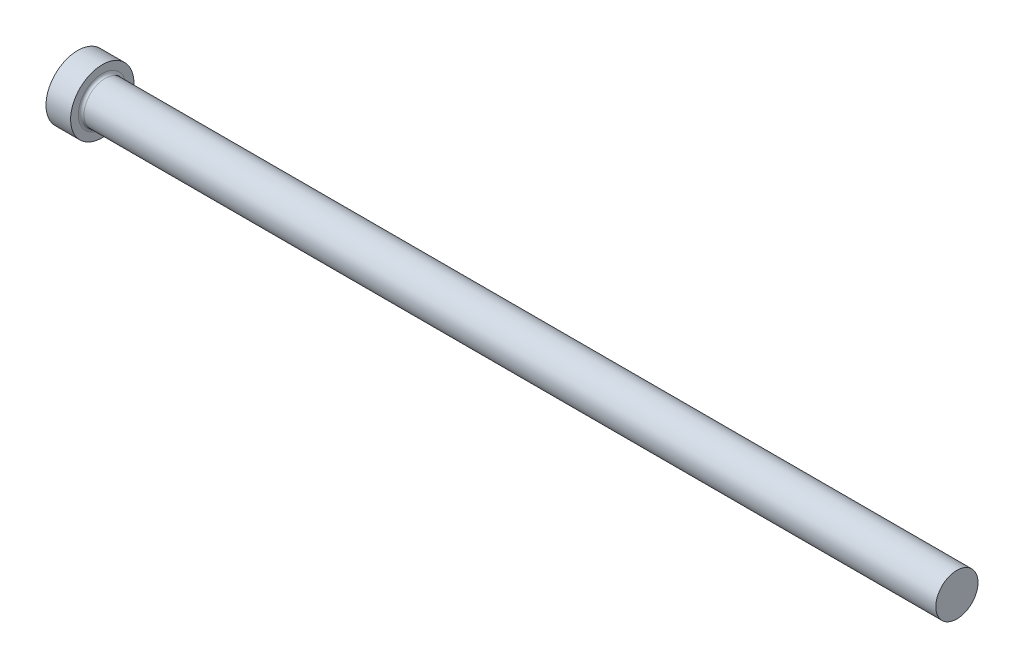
ISO-10303-21;
HEADER;
FILE_DESCRIPTION(('STEP AP214'),'2;1');
FILE_NAME('part.step','',(''),(''),'','','');
FILE_SCHEMA(('AUTOMOTIVE_DESIGN { 1 0 10303 214 1 1 1 1 }'));
ENDSEC;
DATA;
#1=APPLICATION_CONTEXT('core data for automotive mechanical design processes');
#2=APPLICATION_PROTOCOL_DEFINITION('international standard','automotive_design',2000,#1);
#3=PRODUCT_CONTEXT('',#1,'mechanical');
#4=PRODUCT('Part','Part','',(#3));
#5=PRODUCT_RELATED_PRODUCT_CATEGORY('part','',(#4));
#6=PRODUCT_DEFINITION_FORMATION('','',#4);
#7=PRODUCT_DEFINITION_CONTEXT('part definition',#1,'design');
#8=PRODUCT_DEFINITION('design','',#6,#7);
#9=PRODUCT_DEFINITION_SHAPE('','',#8);
#10=(LENGTH_UNIT() NAMED_UNIT(*) SI_UNIT(.MILLI.,.METRE.));
#11=(NAMED_UNIT(*) PLANE_ANGLE_UNIT() SI_UNIT($,.RADIAN.));
#12=(NAMED_UNIT(*) SI_UNIT($,.STERADIAN.) SOLID_ANGLE_UNIT());
#13=UNCERTAINTY_MEASURE_WITH_UNIT(LENGTH_MEASURE(1.E-05),#10,'distance_accuracy_value','');
#14=(GEOMETRIC_REPRESENTATION_CONTEXT(3) GLOBAL_UNCERTAINTY_ASSIGNED_CONTEXT((#13)) GLOBAL_UNIT_ASSIGNED_CONTEXT((#10,
#11,#12)) REPRESENTATION_CONTEXT('',''));
#15=CARTESIAN_POINT('',(0.,0.,0.));
#16=DIRECTION('',(0.,0.,1.));
#17=DIRECTION('',(1.,0.,0.));
#18=AXIS2_PLACEMENT_3D('',#15,#16,#17);
#19=CARTESIAN_POINT('',(0.,0.,0.));
#20=DIRECTION('',(-1.,0.,0.));
#21=DIRECTION('',(0.,-1.,0.));
#22=AXIS2_PLACEMENT_3D('',#19,#20,#21);
#23=PLANE('',#22);
#24=CARTESIAN_POINT('',(0.,0.,0.));
#25=DIRECTION('',(1.,0.,0.));
#26=DIRECTION('',(0.,1.,0.));
#27=AXIS2_PLACEMENT_3D('',#24,#25,#26);
#28=CIRCLE('',#27,9.);
#29=CARTESIAN_POINT('',(0.,9.,0.));
#30=VERTEX_POINT('',#29);
#31=EDGE_CURVE('E25',#30,#30,#28,.T.);
#32=ORIENTED_EDGE('',*,*,#31,.F.);
#33=EDGE_LOOP('',(#32));
#34=FACE_BOUND('',#33,.T.);
#35=ADVANCED_FACE('F14',(#34),#23,.T.);
#36=CARTESIAN_POINT('',(250.,0.,0.));
#37=DIRECTION('',(1.,0.,0.));
#38=DIRECTION('',(0.,1.,0.));
#39=AXIS2_PLACEMENT_3D('',#36,#37,#38);
#40=CYLINDRICAL_SURFACE('',#39,9.);
#41=ORIENTED_EDGE('',*,*,#31,.T.);
#42=EDGE_LOOP('',(#41));
#43=FACE_BOUND('',#42,.T.);
#44=CARTESIAN_POINT('',(7.,0.,0.));
#45=DIRECTION('',(1.,0.,0.));
#46=DIRECTION('',(0.,1.,0.));
#47=AXIS2_PLACEMENT_3D('',#44,#45,#46);
#48=CIRCLE('',#47,9.);
#49=CARTESIAN_POINT('',(7.,9.,0.));
#50=VERTEX_POINT('',#49);
#51=EDGE_CURVE('E29',#50,#50,#48,.T.);
#52=ORIENTED_EDGE('',*,*,#51,.F.);
#53=EDGE_LOOP('',(#52));
#54=FACE_BOUND('',#53,.T.);
#55=ADVANCED_FACE('F51',(#43,#54),#40,.T.);
#56=CARTESIAN_POINT('',(7.,9.,0.));
#57=DIRECTION('',(1.,0.,0.));
#58=DIRECTION('',(0.,1.,0.));
#59=AXIS2_PLACEMENT_3D('',#56,#57,#58);
#60=PLANE('',#59);
#61=CARTESIAN_POINT('',(7.,0.,0.));
#62=DIRECTION('',(1.,0.,0.));
#63=DIRECTION('',(0.,1.,0.));
#64=AXIS2_PLACEMENT_3D('',#61,#62,#63);
#65=CIRCLE('',#64,6.8);
#66=CARTESIAN_POINT('',(7.,6.8,0.));
#67=VERTEX_POINT('',#66);
#68=EDGE_CURVE('E9',#67,#67,#65,.F.);
#69=ORIENTED_EDGE('',*,*,#68,.T.);
#70=EDGE_LOOP('',(#69));
#71=FACE_BOUND('',#70,.T.);
#72=ORIENTED_EDGE('',*,*,#51,.T.);
#73=EDGE_LOOP('',(#72));
#74=FACE_BOUND('',#73,.T.);
#75=ADVANCED_FACE('F42',(#71,#74),#60,.T.);
#76=CARTESIAN_POINT('',(250.,0.,0.));
#77=DIRECTION('',(1.,0.,0.));
#78=DIRECTION('',(0.,1.,0.));
#79=AXIS2_PLACEMENT_3D('',#76,#77,#78);
#80=CYLINDRICAL_SURFACE('',#79,6.);
#81=CARTESIAN_POINT('',(7.8,0.,0.));
#82=DIRECTION('',(1.,0.,0.));
#83=DIRECTION('',(0.,1.,0.));
#84=AXIS2_PLACEMENT_3D('',#81,#82,#83);
#85=CIRCLE('',#84,6.);
#86=CARTESIAN_POINT('',(7.8,6.,0.));
#87=VERTEX_POINT('',#86);
#88=EDGE_CURVE('E21',#87,#87,#85,.T.);
#89=ORIENTED_EDGE('',*,*,#88,.T.);
#90=EDGE_LOOP('',(#89));
#91=FACE_BOUND('',#90,.T.);
#92=CARTESIAN_POINT('',(250.,0.,0.));
#93=DIRECTION('',(1.,0.,0.));
#94=DIRECTION('',(0.,1.,0.));
#95=AXIS2_PLACEMENT_3D('',#92,#93,#94);
#96=CIRCLE('',#95,6.);
#97=CARTESIAN_POINT('',(250.,6.00000000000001,0.));
#98=VERTEX_POINT('',#97);
#99=EDGE_CURVE('E34',#98,#98,#96,.T.);
#100=ORIENTED_EDGE('',*,*,#99,.F.);
#101=EDGE_LOOP('',(#100));
#102=FACE_BOUND('',#101,.T.);
#103=ADVANCED_FACE('F40',(#91,#102),#80,.T.);
#104=CARTESIAN_POINT('',(250.,6.,0.));
#105=DIRECTION('',(1.,0.,0.));
#106=DIRECTION('',(0.,1.,0.));
#107=AXIS2_PLACEMENT_3D('',#104,#105,#106);
#108=PLANE('',#107);
#109=ORIENTED_EDGE('',*,*,#99,.T.);
#110=EDGE_LOOP('',(#109));
#111=FACE_BOUND('',#110,.T.);
#112=ADVANCED_FACE('F38',(#111),#108,.T.);
#113=CARTESIAN_POINT('',(7.8,0.,0.));
#114=DIRECTION('',(1.,0.,0.));
#115=DIRECTION('',(0.,1.,0.));
#116=AXIS2_PLACEMENT_3D('',#113,#114,#115);
#117=TOROIDAL_SURFACE('',#116,6.8,0.8);
#118=ORIENTED_EDGE('',*,*,#68,.F.);
#119=EDGE_LOOP('',(#118));
#120=FACE_BOUND('',#119,.T.);
#121=ORIENTED_EDGE('',*,*,#88,.F.);
#122=EDGE_LOOP('',(#121));
#123=FACE_BOUND('',#122,.T.);
#124=ADVANCED_FACE('F16',(#120,#123),#117,.F.);
#125=CLOSED_SHELL('',(#35,#55,#75,#103,#112,#124));
#126=MANIFOLD_SOLID_BREP('B1',#125);
#127=ADVANCED_BREP_SHAPE_REPRESENTATION('',(#18,#126),#14);
#128=SHAPE_DEFINITION_REPRESENTATION(#9,#127);
ENDSEC;
END-ISO-10303-21;
